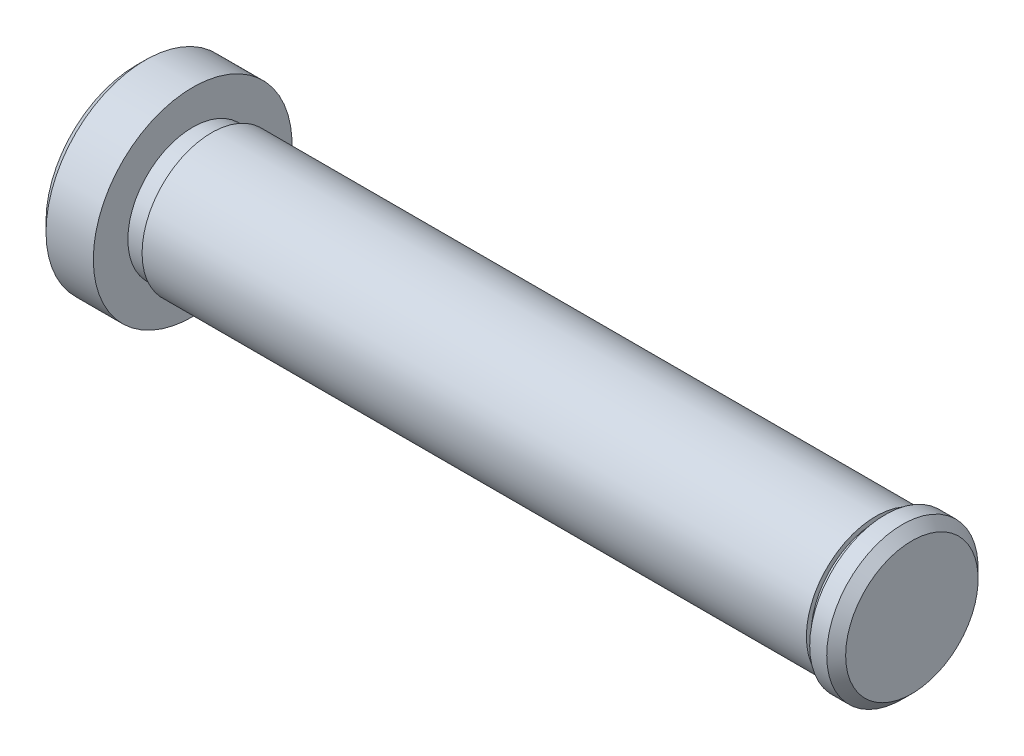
ISO-10303-21;
HEADER;
FILE_DESCRIPTION(('STEP AP214'),'2;1');
FILE_NAME('part.step','',(''),(''),'','','');
FILE_SCHEMA(('AUTOMOTIVE_DESIGN { 1 0 10303 214 1 1 1 1 }'));
ENDSEC;
DATA;
#1=APPLICATION_CONTEXT('core data for automotive mechanical design processes');
#2=APPLICATION_PROTOCOL_DEFINITION('international standard','automotive_design',2000,#1);
#3=PRODUCT_CONTEXT('',#1,'mechanical');
#4=PRODUCT('Part','Part','',(#3));
#5=PRODUCT_RELATED_PRODUCT_CATEGORY('part','',(#4));
#6=PRODUCT_DEFINITION_FORMATION('','',#4);
#7=PRODUCT_DEFINITION_CONTEXT('part definition',#1,'design');
#8=PRODUCT_DEFINITION('design','',#6,#7);
#9=PRODUCT_DEFINITION_SHAPE('','',#8);
#10=(LENGTH_UNIT() NAMED_UNIT(*) SI_UNIT(.MILLI.,.METRE.));
#11=(NAMED_UNIT(*) PLANE_ANGLE_UNIT() SI_UNIT($,.RADIAN.));
#12=(NAMED_UNIT(*) SI_UNIT($,.STERADIAN.) SOLID_ANGLE_UNIT());
#13=UNCERTAINTY_MEASURE_WITH_UNIT(LENGTH_MEASURE(1.E-05),#10,'distance_accuracy_value','');
#14=(GEOMETRIC_REPRESENTATION_CONTEXT(3) GLOBAL_UNCERTAINTY_ASSIGNED_CONTEXT((#13)) GLOBAL_UNIT_ASSIGNED_CONTEXT((#10,
#11,#12)) REPRESENTATION_CONTEXT('',''));
#15=CARTESIAN_POINT('',(0.,0.,0.));
#16=DIRECTION('',(0.,0.,1.));
#17=DIRECTION('',(1.,0.,0.));
#18=AXIS2_PLACEMENT_3D('',#15,#16,#17);
#19=CARTESIAN_POINT('',(82.,0.,0.));
#20=DIRECTION('',(-1.,0.,0.));
#21=DIRECTION('',(0.,0.,1.));
#22=AXIS2_PLACEMENT_3D('',#19,#20,#21);
#23=PLANE('',#22);
#24=CARTESIAN_POINT('',(82.,0.,0.));
#25=DIRECTION('',(-1.,0.,0.));
#26=DIRECTION('',(0.,0.,1.));
#27=AXIS2_PLACEMENT_3D('',#24,#25,#26);
#28=CIRCLE('',#27,7.00000000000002);
#29=CARTESIAN_POINT('',(82.,0.,7.00000000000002));
#30=VERTEX_POINT('',#29);
#31=EDGE_CURVE('E10',#30,#30,#28,.F.);
#32=ORIENTED_EDGE('',*,*,#31,.T.);
#33=EDGE_LOOP('',(#32));
#34=FACE_BOUND('',#33,.T.);
#35=ADVANCED_FACE('F43',(#34),#23,.F.);
#36=CARTESIAN_POINT('',(8.,0.,0.));
#37=DIRECTION('',(-1.,0.,0.));
#38=DIRECTION('',(0.,0.,1.));
#39=AXIS2_PLACEMENT_3D('',#36,#37,#38);
#40=CYLINDRICAL_SURFACE('',#39,8.);
#41=CARTESIAN_POINT('',(81.,0.,0.));
#42=DIRECTION('',(-1.,0.,0.));
#43=DIRECTION('',(0.,0.,1.));
#44=AXIS2_PLACEMENT_3D('',#41,#42,#43);
#45=CIRCLE('',#44,8.);
#46=CARTESIAN_POINT('',(81.,0.,8.));
#47=VERTEX_POINT('',#46);
#48=EDGE_CURVE('E51',#47,#47,#45,.T.);
#49=ORIENTED_EDGE('',*,*,#48,.T.);
#50=EDGE_LOOP('',(#49));
#51=FACE_BOUND('',#50,.T.);
#52=CARTESIAN_POINT('',(79.2,0.,0.));
#53=DIRECTION('',(-1.,0.,0.));
#54=DIRECTION('',(0.,0.,1.));
#55=AXIS2_PLACEMENT_3D('',#52,#53,#54);
#56=CIRCLE('',#55,8.);
#57=CARTESIAN_POINT('',(79.2,0.,8.));
#58=VERTEX_POINT('',#57);
#59=EDGE_CURVE('E63',#58,#58,#56,.T.);
#60=ORIENTED_EDGE('',*,*,#59,.F.);
#61=EDGE_LOOP('',(#60));
#62=FACE_BOUND('',#61,.T.);
#63=ADVANCED_FACE('F108',(#51,#62),#40,.T.);
#64=CARTESIAN_POINT('',(79.2,0.,0.));
#65=DIRECTION('',(-1.,0.,0.));
#66=DIRECTION('',(0.,0.,1.));
#67=AXIS2_PLACEMENT_3D('',#64,#65,#66);
#68=PLANE('',#67);
#69=ORIENTED_EDGE('',*,*,#59,.T.);
#70=EDGE_LOOP('',(#69));
#71=FACE_BOUND('',#70,.T.);
#72=CARTESIAN_POINT('',(79.2,0.,0.));
#73=DIRECTION('',(-1.,0.,0.));
#74=DIRECTION('',(0.,0.,1.));
#75=AXIS2_PLACEMENT_3D('',#72,#73,#74);
#76=CIRCLE('',#75,6.85);
#77=CARTESIAN_POINT('',(79.2,0.,6.85));
#78=VERTEX_POINT('',#77);
#79=EDGE_CURVE('E70',#78,#78,#76,.T.);
#80=ORIENTED_EDGE('',*,*,#79,.F.);
#81=EDGE_LOOP('',(#80));
#82=FACE_BOUND('',#81,.T.);
#83=ADVANCED_FACE('F111',(#71,#82),#68,.T.);
#84=CARTESIAN_POINT('',(8.,0.,0.));
#85=DIRECTION('',(-1.,0.,0.));
#86=DIRECTION('',(0.,0.,1.));
#87=AXIS2_PLACEMENT_3D('',#84,#85,#86);
#88=CYLINDRICAL_SURFACE('',#87,6.85);
#89=ORIENTED_EDGE('',*,*,#79,.T.);
#90=EDGE_LOOP('',(#89));
#91=FACE_BOUND('',#90,.T.);
#92=CARTESIAN_POINT('',(78.2,0.,0.));
#93=DIRECTION('',(-1.,0.,0.));
#94=DIRECTION('',(0.,0.,1.));
#95=AXIS2_PLACEMENT_3D('',#92,#93,#94);
#96=CIRCLE('',#95,6.85);
#97=CARTESIAN_POINT('',(78.2,0.,6.85));
#98=VERTEX_POINT('',#97);
#99=EDGE_CURVE('E66',#98,#98,#96,.T.);
#100=ORIENTED_EDGE('',*,*,#99,.F.);
#101=EDGE_LOOP('',(#100));
#102=FACE_BOUND('',#101,.T.);
#103=ADVANCED_FACE('F195',(#91,#102),#88,.T.);
#104=CARTESIAN_POINT('',(78.2,0.,0.));
#105=DIRECTION('',(-1.,0.,0.));
#106=DIRECTION('',(0.,0.,1.));
#107=AXIS2_PLACEMENT_3D('',#104,#105,#106);
#108=PLANE('',#107);
#109=CARTESIAN_POINT('',(78.2,0.,0.));
#110=DIRECTION('',(-1.,0.,0.));
#111=DIRECTION('',(0.,0.,1.));
#112=AXIS2_PLACEMENT_3D('',#109,#110,#111);
#113=CIRCLE('',#112,7.35);
#114=CARTESIAN_POINT('',(78.2,0.,7.35));
#115=VERTEX_POINT('',#114);
#116=EDGE_CURVE('E71',#115,#115,#113,.T.);
#117=ORIENTED_EDGE('',*,*,#116,.F.);
#118=EDGE_LOOP('',(#117));
#119=FACE_BOUND('',#118,.T.);
#120=ORIENTED_EDGE('',*,*,#99,.T.);
#121=EDGE_LOOP('',(#120));
#122=FACE_BOUND('',#121,.T.);
#123=ADVANCED_FACE('F185',(#119,#122),#108,.F.);
#124=CARTESIAN_POINT('',(8.,0.,0.));
#125=DIRECTION('',(-1.,0.,0.));
#126=DIRECTION('',(0.,0.,1.));
#127=AXIS2_PLACEMENT_3D('',#124,#125,#126);
#128=CYLINDRICAL_SURFACE('',#127,7.35);
#129=ORIENTED_EDGE('',*,*,#116,.T.);
#130=EDGE_LOOP('',(#129));
#131=FACE_BOUND('',#130,.T.);
#132=CARTESIAN_POINT('',(8.,0.,0.));
#133=DIRECTION('',(-1.,0.,0.));
#134=DIRECTION('',(0.,0.,1.));
#135=AXIS2_PLACEMENT_3D('',#132,#133,#134);
#136=CIRCLE('',#135,7.35);
#137=CARTESIAN_POINT('',(8.,0.,7.35));
#138=VERTEX_POINT('',#137);
#139=EDGE_CURVE('E76',#138,#138,#136,.T.);
#140=ORIENTED_EDGE('',*,*,#139,.F.);
#141=EDGE_LOOP('',(#140));
#142=FACE_BOUND('',#141,.T.);
#143=ADVANCED_FACE('F104',(#131,#142),#128,.T.);
#144=CARTESIAN_POINT('',(8.,0.,0.));
#145=DIRECTION('',(-1.,0.,0.));
#146=DIRECTION('',(0.,0.,1.));
#147=AXIS2_PLACEMENT_3D('',#144,#145,#146);
#148=PLANE('',#147);
#149=ORIENTED_EDGE('',*,*,#139,.T.);
#150=EDGE_LOOP('',(#149));
#151=FACE_BOUND('',#150,.T.);
#152=CARTESIAN_POINT('',(8.,0.,0.));
#153=DIRECTION('',(-1.,0.,0.));
#154=DIRECTION('',(0.,0.,1.));
#155=AXIS2_PLACEMENT_3D('',#152,#153,#154);
#156=CIRCLE('',#155,6.85);
#157=CARTESIAN_POINT('',(8.,0.,6.85));
#158=VERTEX_POINT('',#157);
#159=EDGE_CURVE('E78',#158,#158,#156,.T.);
#160=ORIENTED_EDGE('',*,*,#159,.F.);
#161=EDGE_LOOP('',(#160));
#162=FACE_BOUND('',#161,.T.);
#163=ADVANCED_FACE('F97',(#151,#162),#148,.T.);
#164=CARTESIAN_POINT('',(8.,0.,0.));
#165=DIRECTION('',(-1.,0.,0.));
#166=DIRECTION('',(0.,0.,1.));
#167=AXIS2_PLACEMENT_3D('',#164,#165,#166);
#168=CYLINDRICAL_SURFACE('',#167,6.85);
#169=ORIENTED_EDGE('',*,*,#159,.T.);
#170=EDGE_LOOP('',(#169));
#171=FACE_BOUND('',#170,.T.);
#172=CARTESIAN_POINT('',(6.,0.,0.));
#173=DIRECTION('',(-1.,0.,0.));
#174=DIRECTION('',(0.,0.,1.));
#175=AXIS2_PLACEMENT_3D('',#172,#173,#174);
#176=CIRCLE('',#175,6.85);
#177=CARTESIAN_POINT('',(6.,0.,6.85));
#178=VERTEX_POINT('',#177);
#179=EDGE_CURVE('E85',#178,#178,#176,.T.);
#180=ORIENTED_EDGE('',*,*,#179,.F.);
#181=EDGE_LOOP('',(#180));
#182=FACE_BOUND('',#181,.T.);
#183=ADVANCED_FACE('F94',(#171,#182),#168,.T.);
#184=CARTESIAN_POINT('',(6.,0.,0.));
#185=DIRECTION('',(-1.,0.,0.));
#186=DIRECTION('',(0.,0.,1.));
#187=AXIS2_PLACEMENT_3D('',#184,#185,#186);
#188=PLANE('',#187);
#189=CARTESIAN_POINT('',(6.,0.,0.));
#190=DIRECTION('',(-1.,0.,0.));
#191=DIRECTION('',(0.,0.,1.));
#192=AXIS2_PLACEMENT_3D('',#189,#190,#191);
#193=CIRCLE('',#192,10.5);
#194=CARTESIAN_POINT('',(6.,0.,10.5));
#195=VERTEX_POINT('',#194);
#196=EDGE_CURVE('E81',#195,#195,#193,.T.);
#197=ORIENTED_EDGE('',*,*,#196,.F.);
#198=EDGE_LOOP('',(#197));
#199=FACE_BOUND('',#198,.T.);
#200=ORIENTED_EDGE('',*,*,#179,.T.);
#201=EDGE_LOOP('',(#200));
#202=FACE_BOUND('',#201,.T.);
#203=ADVANCED_FACE('F93',(#199,#202),#188,.F.);
#204=CARTESIAN_POINT('',(8.,0.,0.));
#205=DIRECTION('',(-1.,0.,0.));
#206=DIRECTION('',(0.,0.,1.));
#207=AXIS2_PLACEMENT_3D('',#204,#205,#206);
#208=CYLINDRICAL_SURFACE('',#207,10.5);
#209=CARTESIAN_POINT('',(0.999999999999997,0.,0.));
#210=DIRECTION('',(-1.,0.,0.));
#211=DIRECTION('',(0.,0.,1.));
#212=AXIS2_PLACEMENT_3D('',#209,#210,#211);
#213=CIRCLE('',#212,10.5);
#214=CARTESIAN_POINT('',(0.999999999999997,0.,10.5));
#215=VERTEX_POINT('',#214);
#216=EDGE_CURVE('E54',#215,#215,#213,.F.);
#217=ORIENTED_EDGE('',*,*,#216,.T.);
#218=EDGE_LOOP('',(#217));
#219=FACE_BOUND('',#218,.T.);
#220=ORIENTED_EDGE('',*,*,#196,.T.);
#221=EDGE_LOOP('',(#220));
#222=FACE_BOUND('',#221,.T.);
#223=ADVANCED_FACE('F90',(#219,#222),#208,.T.);
#224=CARTESIAN_POINT('',(0.,0.,0.));
#225=DIRECTION('',(-1.,0.,0.));
#226=DIRECTION('',(0.,0.,1.));
#227=AXIS2_PLACEMENT_3D('',#224,#225,#226);
#228=PLANE('',#227);
#229=CARTESIAN_POINT('',(0.,0.,0.));
#230=DIRECTION('',(-1.,0.,0.));
#231=DIRECTION('',(0.,0.,1.));
#232=AXIS2_PLACEMENT_3D('',#229,#230,#231);
#233=CIRCLE('',#232,9.50000000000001);
#234=CARTESIAN_POINT('',(0.,0.,9.50000000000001));
#235=VERTEX_POINT('',#234);
#236=EDGE_CURVE('E56',#235,#235,#233,.T.);
#237=ORIENTED_EDGE('',*,*,#236,.T.);
#238=EDGE_LOOP('',(#237));
#239=FACE_BOUND('',#238,.T.);
#240=ADVANCED_FACE('F125',(#239),#228,.T.);
#241=CARTESIAN_POINT('',(0.,0.,0.));
#242=DIRECTION('',(1.,0.,0.));
#243=DIRECTION('',(0.,0.,-1.));
#244=AXIS2_PLACEMENT_3D('',#241,#242,#243);
#245=CONICAL_SURFACE('',#244,9.50000000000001,0.785398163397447);
#246=ORIENTED_EDGE('',*,*,#216,.F.);
#247=EDGE_LOOP('',(#246));
#248=FACE_BOUND('',#247,.T.);
#249=ORIENTED_EDGE('',*,*,#236,.F.);
#250=EDGE_LOOP('',(#249));
#251=FACE_BOUND('',#250,.T.);
#252=ADVANCED_FACE('F117',(#248,#251),#245,.T.);
#253=CARTESIAN_POINT('',(81.,0.,0.));
#254=DIRECTION('',(-1.,0.,0.));
#255=DIRECTION('',(0.,0.,1.));
#256=AXIS2_PLACEMENT_3D('',#253,#254,#255);
#257=CONICAL_SURFACE('',#256,8.,0.785398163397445);
#258=ORIENTED_EDGE('',*,*,#31,.F.);
#259=EDGE_LOOP('',(#258));
#260=FACE_BOUND('',#259,.T.);
#261=ORIENTED_EDGE('',*,*,#48,.F.);
#262=EDGE_LOOP('',(#261));
#263=FACE_BOUND('',#262,.T.);
#264=ADVANCED_FACE('F46',(#260,#263),#257,.T.);
#265=CLOSED_SHELL('',(#35,#63,#83,#103,#123,#143,#163,#183,#203,#223,#240,#252,#264));
#266=MANIFOLD_SOLID_BREP('B2',#265);
#267=ADVANCED_BREP_SHAPE_REPRESENTATION('',(#18,#266),#14);
#268=SHAPE_DEFINITION_REPRESENTATION(#9,#267);
ENDSEC;
END-ISO-10303-21;
